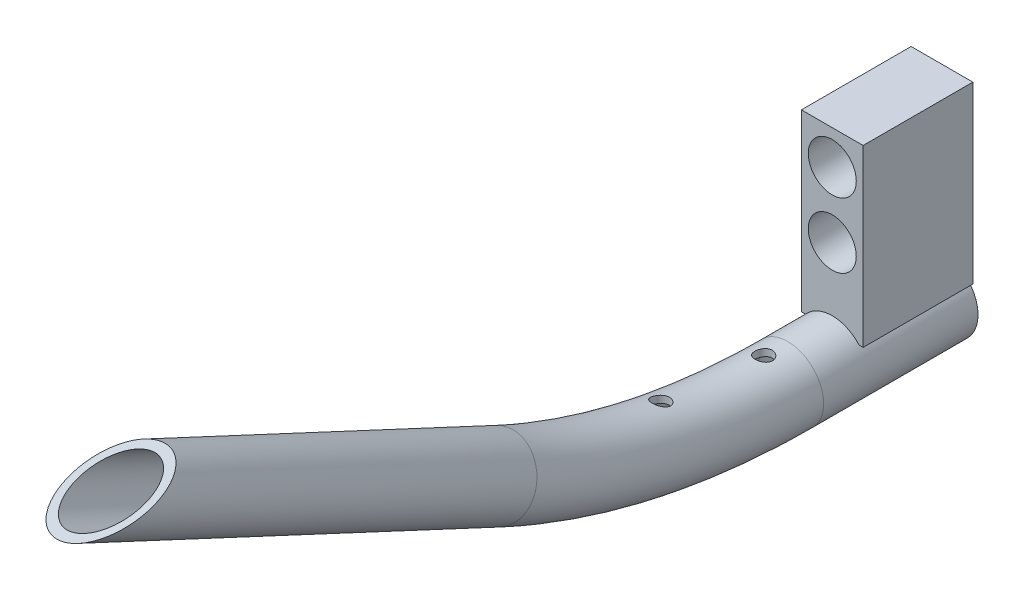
from build123d import *

# Parameters (mm, degrees)
ESQUISSE1_R      = 10.5
ESQUISSE1_R_2    = 8.5
EXTRUSION1_DEPTH = 15
ESQUISSE6_R      = 2.5
EXTRUSION2_DEPTH = 21
EXTRUSION3_START = -32
ESQUISSE7_R      = 4.25
EXTRUSION3_DEPTH = 32
ESQUISSE8_R      = 7
EXTRUSION4_DEPTH = 11


with BuildPart() as part:
    # Balayage1: sweep along a path in Esquisse2
    with BuildLine(Plane(origin=(0, 0, 0), x_dir=(0, 0, -1), z_dir=(1, 0, 0))) as balayage1_path:
        Line((0, 0), (-45, 0))
        ThreePointArc((-45, 0), (-88.287922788, 4.740798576), (-129.523652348, 18.738442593))
        Line((-129.523652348, 18.738442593), (-253.677865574, 76.632503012))
    # Esquisse1 → Balayage1 (sweep)
    with BuildSketch(Plane.XY):
        Circle(ESQUISSE1_R)
        Circle(ESQUISSE1_R_2, mode=Mode.SUBTRACT)
    sweep(path=balayage1_path.line)

    # Esquisse5 → Extrusion1 (cut, symmetric)
    with BuildSketch(Plane(origin=(0, 0, 0), x_dir=(0, 0, -1), z_dir=(1, 0, 0))):
        Polygon((-258.115357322, 67.116271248), (-221.117815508, 77.029732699), (-227.927323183, 102.443161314), (-264.924864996, 92.529699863), align=None)
    extrude(amount=EXTRUSION1_DEPTH, both=True, mode=Mode.SUBTRACT)

    # Esquisse6 → Extrusion2 (cut)
    with BuildSketch(Plane(origin=(0, 0, 0), x_dir=(1, 0, 0), z_dir=(0, 1, 0))):
        with Locations(Location((0, -82, 0), (0, 0, 123.992674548))):
            Circle(ESQUISSE6_R)
        with Locations(Location((0, -52, 0), (0, 0, 124.99048388))):
            Circle(ESQUISSE6_R)
    extrude(amount=EXTRUSION2_DEPTH, mode=Mode.SUBTRACT)

    # Esquisse7 → Extrusion3 (add)
    with BuildSketch(Plane(origin=(0, 0, 0), x_dir=(-1, 0, 0), z_dir=(0, 0, -1)).offset(EXTRUSION3_START)):
        with BuildLine():
            Line((-9, 58), (9, 58))
            Line((9, 58), (9, 7))
            Line((9, 7), (7.826237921, 7))
            ThreePointArc((7.826237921, 7), (0, 10.5), (-7.826237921, 7))
            Line((-7.826237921, 7), (-9, 7))
            Line((-9, 7), (-9, 58))
        make_face()
        with Locations((0, 48)):
            Circle(ESQUISSE7_R, mode=Mode.SUBTRACT)
        with Locations((0, 29)):
            Circle(ESQUISSE7_R, mode=Mode.SUBTRACT)
    extrude(amount=EXTRUSION3_DEPTH)

    # Esquisse8 → Extrusion4 (cut)
    with BuildSketch(Plane.XY.offset(32)):
        with Locations((0, 48)):
            Circle(ESQUISSE8_R)
        with Locations((0, 29)):
            Circle(ESQUISSE8_R)
    extrude(amount=-EXTRUSION4_DEPTH, mode=Mode.SUBTRACT)


solid = part.part
